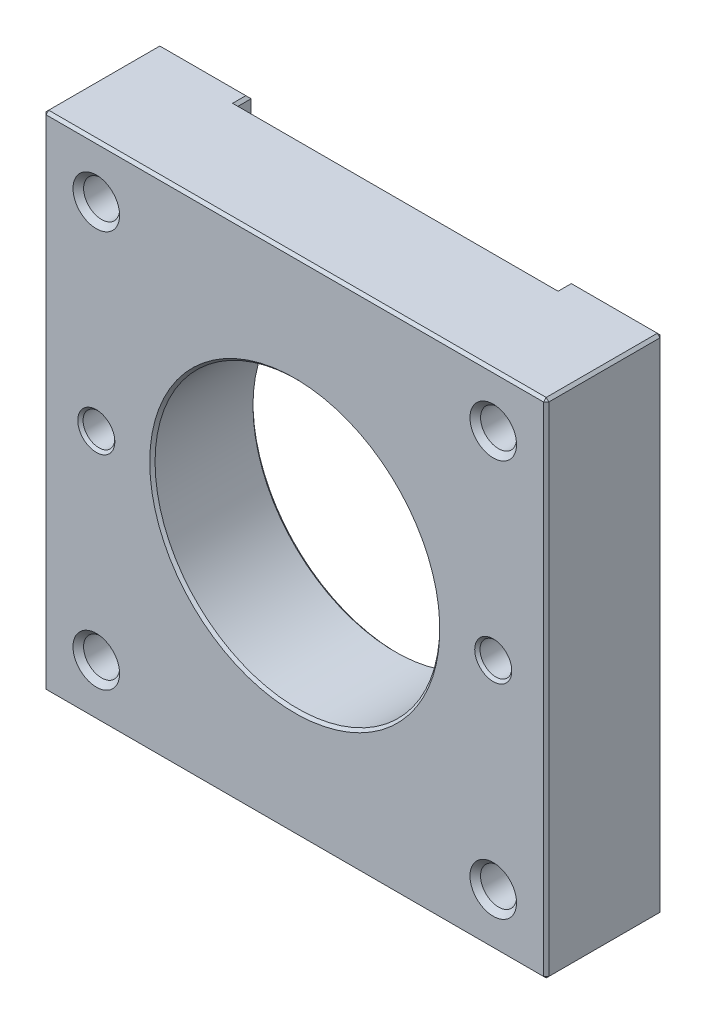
ISO-10303-21;
HEADER;
FILE_DESCRIPTION(('STEP AP214'),'2;1');
FILE_NAME('part.step','',(''),(''),'','','');
FILE_SCHEMA(('AUTOMOTIVE_DESIGN { 1 0 10303 214 1 1 1 1 }'));
ENDSEC;
DATA;
#1=APPLICATION_CONTEXT('core data for automotive mechanical design processes');
#2=APPLICATION_PROTOCOL_DEFINITION('international standard','automotive_design',2000,#1);
#3=PRODUCT_CONTEXT('',#1,'mechanical');
#4=PRODUCT('Part','Part','',(#3));
#5=PRODUCT_RELATED_PRODUCT_CATEGORY('part','',(#4));
#6=PRODUCT_DEFINITION_FORMATION('','',#4);
#7=PRODUCT_DEFINITION_CONTEXT('part definition',#1,'design');
#8=PRODUCT_DEFINITION('design','',#6,#7);
#9=PRODUCT_DEFINITION_SHAPE('','',#8);
#10=(LENGTH_UNIT() NAMED_UNIT(*) SI_UNIT(.MILLI.,.METRE.));
#11=(NAMED_UNIT(*) PLANE_ANGLE_UNIT() SI_UNIT($,.RADIAN.));
#12=(NAMED_UNIT(*) SI_UNIT($,.STERADIAN.) SOLID_ANGLE_UNIT());
#13=UNCERTAINTY_MEASURE_WITH_UNIT(LENGTH_MEASURE(1.E-05),#10,'distance_accuracy_value','');
#14=(GEOMETRIC_REPRESENTATION_CONTEXT(3) GLOBAL_UNCERTAINTY_ASSIGNED_CONTEXT((#13)) GLOBAL_UNIT_ASSIGNED_CONTEXT((#10,
#11,#12)) REPRESENTATION_CONTEXT('',''));
#15=CARTESIAN_POINT('',(0.,0.,0.));
#16=DIRECTION('',(0.,0.,1.));
#17=DIRECTION('',(1.,0.,0.));
#18=AXIS2_PLACEMENT_3D('',#15,#16,#17);
#19=CARTESIAN_POINT('',(-47.5,-47.5,0.));
#20=DIRECTION('',(0.,0.,-1.));
#21=DIRECTION('',(-1.,0.,0.));
#22=AXIS2_PLACEMENT_3D('',#19,#20,#21);
#23=PLANE('',#22);
#24=CARTESIAN_POINT('',(37.5,0.,0.));
#25=DIRECTION('',(0.,0.,-1.));
#26=DIRECTION('',(-1.,0.,0.));
#27=AXIS2_PLACEMENT_3D('',#24,#25,#26);
#28=CIRCLE('',#27,3.50000000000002);
#29=CARTESIAN_POINT('',(34.,0.,0.));
#30=VERTEX_POINT('',#29);
#31=EDGE_CURVE('E554',#30,#30,#28,.F.);
#32=ORIENTED_EDGE('',*,*,#31,.T.);
#33=EDGE_LOOP('',(#32));
#34=FACE_BOUND('',#33,.T.);
#35=CARTESIAN_POINT('',(37.5,37.5,0.));
#36=DIRECTION('',(0.,0.,-1.));
#37=DIRECTION('',(-1.,0.,0.));
#38=AXIS2_PLACEMENT_3D('',#35,#36,#37);
#39=CIRCLE('',#38,4.40000000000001);
#40=CARTESIAN_POINT('',(33.1,37.5,0.));
#41=VERTEX_POINT('',#40);
#42=EDGE_CURVE('E509',#41,#41,#39,.F.);
#43=ORIENTED_EDGE('',*,*,#42,.T.);
#44=EDGE_LOOP('',(#43));
#45=FACE_BOUND('',#44,.T.);
#46=CARTESIAN_POINT('',(37.5,-37.5,0.));
#47=DIRECTION('',(0.,0.,-1.));
#48=DIRECTION('',(-1.,0.,0.));
#49=AXIS2_PLACEMENT_3D('',#46,#47,#48);
#50=CIRCLE('',#49,4.40000000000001);
#51=CARTESIAN_POINT('',(33.1,-37.5,0.));
#52=VERTEX_POINT('',#51);
#53=EDGE_CURVE('E506',#52,#52,#50,.F.);
#54=ORIENTED_EDGE('',*,*,#53,.T.);
#55=EDGE_LOOP('',(#54));
#56=FACE_BOUND('',#55,.T.);
#57=DIRECTION('',(0.,-1.,0.));
#58=VECTOR('',#57,1.);
#59=CARTESIAN_POINT('',(30.25,47.5,0.));
#60=LINE('',#59,#58);
#61=CARTESIAN_POINT('',(30.25,47.,0.));
#62=VERTEX_POINT('',#61);
#63=CARTESIAN_POINT('',(30.25,-47.,0.));
#64=VERTEX_POINT('',#63);
#65=EDGE_CURVE('E182',#62,#64,#60,.T.);
#66=ORIENTED_EDGE('',*,*,#65,.F.);
#67=DIRECTION('',(1.,0.,0.));
#68=VECTOR('',#67,1.);
#69=CARTESIAN_POINT('',(-47.5,47.,0.));
#70=LINE('',#69,#68);
#71=CARTESIAN_POINT('',(47.,47.,0.));
#72=VERTEX_POINT('',#71);
#73=EDGE_CURVE('E196',#62,#72,#70,.T.);
#74=ORIENTED_EDGE('',*,*,#73,.T.);
#75=DIRECTION('',(0.,-1.,0.));
#76=VECTOR('',#75,1.);
#77=CARTESIAN_POINT('',(47.,-47.5,0.));
#78=LINE('',#77,#76);
#79=CARTESIAN_POINT('',(47.,-47.,0.));
#80=VERTEX_POINT('',#79);
#81=EDGE_CURVE('E215',#72,#80,#78,.T.);
#82=ORIENTED_EDGE('',*,*,#81,.T.);
#83=DIRECTION('',(-1.,0.,0.));
#84=VECTOR('',#83,1.);
#85=CARTESIAN_POINT('',(-47.5,-47.,0.));
#86=LINE('',#85,#84);
#87=EDGE_CURVE('E198',#80,#64,#86,.T.);
#88=ORIENTED_EDGE('',*,*,#87,.T.);
#89=EDGE_LOOP('',(#66,#74,#82,#88));
#90=FACE_BOUND('',#89,.T.);
#91=ADVANCED_FACE('F41',(#34,#45,#56,#90),#23,.T.);
#92=CARTESIAN_POINT('',(-47.5,-47.5,22.));
#93=DIRECTION('',(0.,0.,-1.));
#94=DIRECTION('',(-1.,0.,0.));
#95=AXIS2_PLACEMENT_3D('',#92,#93,#94);
#96=PLANE('',#95);
#97=DIRECTION('',(0.,1.,0.));
#98=VECTOR('',#97,1.);
#99=CARTESIAN_POINT('',(47.,-47.5,22.));
#100=LINE('',#99,#98);
#101=CARTESIAN_POINT('',(47.,-47.,22.));
#102=VERTEX_POINT('',#101);
#103=CARTESIAN_POINT('',(47.,47.,22.));
#104=VERTEX_POINT('',#103);
#105=EDGE_CURVE('E236',#102,#104,#100,.T.);
#106=ORIENTED_EDGE('',*,*,#105,.T.);
#107=DIRECTION('',(-1.,0.,0.));
#108=VECTOR('',#107,1.);
#109=CARTESIAN_POINT('',(-47.5,47.,22.));
#110=LINE('',#109,#108);
#111=CARTESIAN_POINT('',(-47.,47.,22.));
#112=VERTEX_POINT('',#111);
#113=EDGE_CURVE('E240',#104,#112,#110,.T.);
#114=ORIENTED_EDGE('',*,*,#113,.T.);
#115=DIRECTION('',(0.,-1.,0.));
#116=VECTOR('',#115,1.);
#117=CARTESIAN_POINT('',(-47.,-47.5,22.));
#118=LINE('',#117,#116);
#119=CARTESIAN_POINT('',(-47.,-47.,22.));
#120=VERTEX_POINT('',#119);
#121=EDGE_CURVE('E238',#112,#120,#118,.T.);
#122=ORIENTED_EDGE('',*,*,#121,.T.);
#123=DIRECTION('',(1.,0.,0.));
#124=VECTOR('',#123,1.);
#125=CARTESIAN_POINT('',(47.5,-47.,22.));
#126=LINE('',#125,#124);
#127=EDGE_CURVE('E234',#120,#102,#126,.T.);
#128=ORIENTED_EDGE('',*,*,#127,.T.);
#129=EDGE_LOOP('',(#106,#114,#122,#128));
#130=FACE_BOUND('',#129,.T.);
#131=CARTESIAN_POINT('',(0.,0.,22.));
#132=DIRECTION('',(0.,0.,-1.));
#133=DIRECTION('',(-1.,0.,0.));
#134=AXIS2_PLACEMENT_3D('',#131,#132,#133);
#135=CIRCLE('',#134,27.4);
#136=CARTESIAN_POINT('',(-27.4,0.,22.));
#137=VERTEX_POINT('',#136);
#138=EDGE_CURVE('E542',#137,#137,#135,.T.);
#139=ORIENTED_EDGE('',*,*,#138,.T.);
#140=EDGE_LOOP('',(#139));
#141=FACE_BOUND('',#140,.T.);
#142=CARTESIAN_POINT('',(-37.5,0.,22.));
#143=DIRECTION('',(0.,0.,-1.));
#144=DIRECTION('',(-1.,0.,0.));
#145=AXIS2_PLACEMENT_3D('',#142,#143,#144);
#146=CIRCLE('',#145,3.50000000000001);
#147=CARTESIAN_POINT('',(-41.,0.,22.));
#148=VERTEX_POINT('',#147);
#149=EDGE_CURVE('E539',#148,#148,#146,.T.);
#150=ORIENTED_EDGE('',*,*,#149,.T.);
#151=EDGE_LOOP('',(#150));
#152=FACE_BOUND('',#151,.T.);
#153=CARTESIAN_POINT('',(37.5,0.,22.));
#154=DIRECTION('',(0.,0.,-1.));
#155=DIRECTION('',(-1.,0.,0.));
#156=AXIS2_PLACEMENT_3D('',#153,#154,#155);
#157=CIRCLE('',#156,3.50000000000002);
#158=CARTESIAN_POINT('',(34.,0.,22.));
#159=VERTEX_POINT('',#158);
#160=EDGE_CURVE('E536',#159,#159,#157,.T.);
#161=ORIENTED_EDGE('',*,*,#160,.T.);
#162=EDGE_LOOP('',(#161));
#163=FACE_BOUND('',#162,.T.);
#164=CARTESIAN_POINT('',(-37.5,37.5,22.));
#165=DIRECTION('',(0.,0.,-1.));
#166=DIRECTION('',(-1.,0.,0.));
#167=AXIS2_PLACEMENT_3D('',#164,#165,#166);
#168=CIRCLE('',#167,4.40000000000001);
#169=CARTESIAN_POINT('',(-41.9,37.5,22.));
#170=VERTEX_POINT('',#169);
#171=EDGE_CURVE('E491',#170,#170,#168,.T.);
#172=ORIENTED_EDGE('',*,*,#171,.T.);
#173=EDGE_LOOP('',(#172));
#174=FACE_BOUND('',#173,.T.);
#175=CARTESIAN_POINT('',(-37.5,-37.5,22.));
#176=DIRECTION('',(0.,0.,-1.));
#177=DIRECTION('',(-1.,0.,0.));
#178=AXIS2_PLACEMENT_3D('',#175,#176,#177);
#179=CIRCLE('',#178,4.40000000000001);
#180=CARTESIAN_POINT('',(-41.9,-37.5,22.));
#181=VERTEX_POINT('',#180);
#182=EDGE_CURVE('E488',#181,#181,#179,.T.);
#183=ORIENTED_EDGE('',*,*,#182,.T.);
#184=EDGE_LOOP('',(#183));
#185=FACE_BOUND('',#184,.T.);
#186=CARTESIAN_POINT('',(37.5,37.5,22.));
#187=DIRECTION('',(0.,0.,-1.));
#188=DIRECTION('',(-1.,0.,0.));
#189=AXIS2_PLACEMENT_3D('',#186,#187,#188);
#190=CIRCLE('',#189,4.40000000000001);
#191=CARTESIAN_POINT('',(33.1,37.5,22.));
#192=VERTEX_POINT('',#191);
#193=EDGE_CURVE('E481',#192,#192,#190,.T.);
#194=ORIENTED_EDGE('',*,*,#193,.T.);
#195=EDGE_LOOP('',(#194));
#196=FACE_BOUND('',#195,.T.);
#197=CARTESIAN_POINT('',(37.5,-37.5,22.));
#198=DIRECTION('',(0.,0.,-1.));
#199=DIRECTION('',(-1.,0.,0.));
#200=AXIS2_PLACEMENT_3D('',#197,#198,#199);
#201=CIRCLE('',#200,4.40000000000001);
#202=CARTESIAN_POINT('',(33.1,-37.5,22.));
#203=VERTEX_POINT('',#202);
#204=EDGE_CURVE('E478',#203,#203,#201,.T.);
#205=ORIENTED_EDGE('',*,*,#204,.T.);
#206=EDGE_LOOP('',(#205));
#207=FACE_BOUND('',#206,.T.);
#208=ADVANCED_FACE('F431',(#130,#141,#152,#163,#174,#185,#196,#207),#96,.F.);
#209=CARTESIAN_POINT('',(-37.5,0.,0.));
#210=DIRECTION('',(0.,0.,-1.));
#211=DIRECTION('',(-1.,0.,0.));
#212=AXIS2_PLACEMENT_3D('',#209,#210,#211);
#213=CIRCLE('',#212,3.50000000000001);
#214=CARTESIAN_POINT('',(-41.,0.,0.));
#215=VERTEX_POINT('',#214);
#216=EDGE_CURVE('E557',#215,#215,#213,.F.);
#217=ORIENTED_EDGE('',*,*,#216,.T.);
#218=EDGE_LOOP('',(#217));
#219=FACE_BOUND('',#218,.T.);
#220=CARTESIAN_POINT('',(-37.5,37.5,0.));
#221=DIRECTION('',(0.,0.,-1.));
#222=DIRECTION('',(-1.,0.,0.));
#223=AXIS2_PLACEMENT_3D('',#220,#221,#222);
#224=CIRCLE('',#223,4.40000000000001);
#225=CARTESIAN_POINT('',(-41.9,37.5,0.));
#226=VERTEX_POINT('',#225);
#227=EDGE_CURVE('E521',#226,#226,#224,.F.);
#228=ORIENTED_EDGE('',*,*,#227,.T.);
#229=EDGE_LOOP('',(#228));
#230=FACE_BOUND('',#229,.T.);
#231=CARTESIAN_POINT('',(-37.5,-37.5,0.));
#232=DIRECTION('',(0.,0.,-1.));
#233=DIRECTION('',(-1.,0.,0.));
#234=AXIS2_PLACEMENT_3D('',#231,#232,#233);
#235=CIRCLE('',#234,4.40000000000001);
#236=CARTESIAN_POINT('',(-41.9,-37.5,0.));
#237=VERTEX_POINT('',#236);
#238=EDGE_CURVE('E518',#237,#237,#235,.F.);
#239=ORIENTED_EDGE('',*,*,#238,.T.);
#240=EDGE_LOOP('',(#239));
#241=FACE_BOUND('',#240,.T.);
#242=DIRECTION('',(0.,1.,0.));
#243=VECTOR('',#242,1.);
#244=CARTESIAN_POINT('',(-47.,47.5,0.));
#245=LINE('',#244,#243);
#246=CARTESIAN_POINT('',(-47.,-47.,0.));
#247=VERTEX_POINT('',#246);
#248=CARTESIAN_POINT('',(-47.,47.,0.));
#249=VERTEX_POINT('',#248);
#250=EDGE_CURVE('E245',#247,#249,#245,.T.);
#251=ORIENTED_EDGE('',*,*,#250,.T.);
#252=DIRECTION('',(1.,0.,0.));
#253=VECTOR('',#252,1.);
#254=CARTESIAN_POINT('',(-47.5,47.,0.));
#255=LINE('',#254,#253);
#256=CARTESIAN_POINT('',(-30.25,47.,0.));
#257=VERTEX_POINT('',#256);
#258=EDGE_CURVE('E247',#249,#257,#255,.T.);
#259=ORIENTED_EDGE('',*,*,#258,.T.);
#260=DIRECTION('',(0.,1.,0.));
#261=VECTOR('',#260,1.);
#262=CARTESIAN_POINT('',(-30.25,-47.5,0.));
#263=LINE('',#262,#261);
#264=CARTESIAN_POINT('',(-30.25,-47.,0.));
#265=VERTEX_POINT('',#264);
#266=EDGE_CURVE('E199',#265,#257,#263,.T.);
#267=ORIENTED_EDGE('',*,*,#266,.F.);
#268=DIRECTION('',(-1.,0.,0.));
#269=VECTOR('',#268,1.);
#270=CARTESIAN_POINT('',(-47.5,-47.,0.));
#271=LINE('',#270,#269);
#272=EDGE_CURVE('E243',#265,#247,#271,.T.);
#273=ORIENTED_EDGE('',*,*,#272,.T.);
#274=EDGE_LOOP('',(#251,#259,#267,#273));
#275=FACE_BOUND('',#274,.T.);
#276=ADVANCED_FACE('F384',(#219,#230,#241,#275),#23,.T.);
#277=CARTESIAN_POINT('',(-47.5,47.5,22.));
#278=DIRECTION('',(1.,0.,0.));
#279=DIRECTION('',(0.,1.,0.));
#280=AXIS2_PLACEMENT_3D('',#277,#278,#279);
#281=PLANE('',#280);
#282=DIRECTION('',(0.,1.,0.));
#283=VECTOR('',#282,1.);
#284=CARTESIAN_POINT('',(-47.5,47.5,21.5));
#285=LINE('',#284,#283);
#286=CARTESIAN_POINT('',(-47.5,-47.,21.5));
#287=VERTEX_POINT('',#286);
#288=CARTESIAN_POINT('',(-47.5,47.,21.5));
#289=VERTEX_POINT('',#288);
#290=EDGE_CURVE('E261',#287,#289,#285,.T.);
#291=ORIENTED_EDGE('',*,*,#290,.T.);
#292=DIRECTION('',(0.,0.,-1.));
#293=VECTOR('',#292,1.);
#294=CARTESIAN_POINT('',(-47.5,47.,0.));
#295=LINE('',#294,#293);
#296=CARTESIAN_POINT('',(-47.5,47.,0.500000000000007));
#297=VERTEX_POINT('',#296);
#298=EDGE_CURVE('E263',#289,#297,#295,.T.);
#299=ORIENTED_EDGE('',*,*,#298,.T.);
#300=DIRECTION('',(0.,-1.,0.));
#301=VECTOR('',#300,1.);
#302=CARTESIAN_POINT('',(-47.5,-47.5,0.500000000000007));
#303=LINE('',#302,#301);
#304=CARTESIAN_POINT('',(-47.5,-47.,0.500000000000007));
#305=VERTEX_POINT('',#304);
#306=EDGE_CURVE('E259',#297,#305,#303,.T.);
#307=ORIENTED_EDGE('',*,*,#306,.T.);
#308=DIRECTION('',(0.,0.,1.));
#309=VECTOR('',#308,1.);
#310=CARTESIAN_POINT('',(-47.5,-47.,22.));
#311=LINE('',#310,#309);
#312=EDGE_CURVE('E190',#305,#287,#311,.T.);
#313=ORIENTED_EDGE('',*,*,#312,.T.);
#314=EDGE_LOOP('',(#291,#299,#307,#313));
#315=FACE_BOUND('',#314,.T.);
#316=ADVANCED_FACE('F453',(#315),#281,.F.);
#317=CARTESIAN_POINT('',(47.5,-47.5,22.));
#318=DIRECTION('',(0.,-1.,0.));
#319=DIRECTION('',(1.,0.,0.));
#320=AXIS2_PLACEMENT_3D('',#317,#318,#319);
#321=PLANE('',#320);
#322=DIRECTION('',(0.,0.,1.));
#323=VECTOR('',#322,1.);
#324=CARTESIAN_POINT('',(-30.75,-47.5,2.5));
#325=LINE('',#324,#323);
#326=CARTESIAN_POINT('',(-30.75,-47.5,0.500000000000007));
#327=VERTEX_POINT('',#326);
#328=CARTESIAN_POINT('',(-30.75,-47.5,3.00000000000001));
#329=VERTEX_POINT('',#328);
#330=EDGE_CURVE('E50',#327,#329,#325,.T.);
#331=ORIENTED_EDGE('',*,*,#330,.T.);
#332=DIRECTION('',(1.,0.,0.));
#333=VECTOR('',#332,1.);
#334=CARTESIAN_POINT('',(30.25,-47.5,3.00000000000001));
#335=LINE('',#334,#333);
#336=CARTESIAN_POINT('',(30.75,-47.5,3.00000000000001));
#337=VERTEX_POINT('',#336);
#338=EDGE_CURVE('E11',#329,#337,#335,.T.);
#339=ORIENTED_EDGE('',*,*,#338,.T.);
#340=DIRECTION('',(0.,0.,-1.));
#341=VECTOR('',#340,1.);
#342=CARTESIAN_POINT('',(30.75,-47.5,0.));
#343=LINE('',#342,#341);
#344=CARTESIAN_POINT('',(30.75,-47.5,0.500000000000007));
#345=VERTEX_POINT('',#344);
#346=EDGE_CURVE('E275',#337,#345,#343,.T.);
#347=ORIENTED_EDGE('',*,*,#346,.T.);
#348=DIRECTION('',(1.,0.,0.));
#349=VECTOR('',#348,1.);
#350=CARTESIAN_POINT('',(47.5,-47.5,0.500000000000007));
#351=LINE('',#350,#349);
#352=CARTESIAN_POINT('',(47.,-47.5,0.500000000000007));
#353=VERTEX_POINT('',#352);
#354=EDGE_CURVE('E277',#345,#353,#351,.T.);
#355=ORIENTED_EDGE('',*,*,#354,.T.);
#356=DIRECTION('',(0.,0.,1.));
#357=VECTOR('',#356,1.);
#358=CARTESIAN_POINT('',(47.,-47.5,22.));
#359=LINE('',#358,#357);
#360=CARTESIAN_POINT('',(47.,-47.5,21.5));
#361=VERTEX_POINT('',#360);
#362=EDGE_CURVE('E279',#353,#361,#359,.T.);
#363=ORIENTED_EDGE('',*,*,#362,.T.);
#364=DIRECTION('',(-1.,0.,0.));
#365=VECTOR('',#364,1.);
#366=CARTESIAN_POINT('',(-47.5,-47.5,21.5));
#367=LINE('',#366,#365);
#368=CARTESIAN_POINT('',(-47.,-47.5,21.5));
#369=VERTEX_POINT('',#368);
#370=EDGE_CURVE('E281',#361,#369,#367,.T.);
#371=ORIENTED_EDGE('',*,*,#370,.T.);
#372=DIRECTION('',(0.,0.,-1.));
#373=VECTOR('',#372,1.);
#374=CARTESIAN_POINT('',(-47.,-47.5,0.));
#375=LINE('',#374,#373);
#376=CARTESIAN_POINT('',(-47.,-47.5,0.500000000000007));
#377=VERTEX_POINT('',#376);
#378=EDGE_CURVE('E283',#369,#377,#375,.T.);
#379=ORIENTED_EDGE('',*,*,#378,.T.);
#380=DIRECTION('',(1.,0.,0.));
#381=VECTOR('',#380,1.);
#382=CARTESIAN_POINT('',(47.5,-47.5,0.500000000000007));
#383=LINE('',#382,#381);
#384=EDGE_CURVE('E61',#377,#327,#383,.T.);
#385=ORIENTED_EDGE('',*,*,#384,.T.);
#386=EDGE_LOOP('',(#331,#339,#347,#355,#363,#371,#379,#385));
#387=FACE_BOUND('',#386,.T.);
#388=ADVANCED_FACE('F398',(#387),#321,.T.);
#389=CARTESIAN_POINT('',(47.5,-47.5,22.));
#390=DIRECTION('',(-1.,0.,0.));
#391=DIRECTION('',(0.,0.,1.));
#392=AXIS2_PLACEMENT_3D('',#389,#390,#391);
#393=PLANE('',#392);
#394=DIRECTION('',(0.,0.,1.));
#395=VECTOR('',#394,1.);
#396=CARTESIAN_POINT('',(47.5,47.,22.));
#397=LINE('',#396,#395);
#398=CARTESIAN_POINT('',(47.5,47.,0.500000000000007));
#399=VERTEX_POINT('',#398);
#400=CARTESIAN_POINT('',(47.5,47.,21.5));
#401=VERTEX_POINT('',#400);
#402=EDGE_CURVE('E270',#399,#401,#397,.T.);
#403=ORIENTED_EDGE('',*,*,#402,.T.);
#404=DIRECTION('',(0.,-1.,0.));
#405=VECTOR('',#404,1.);
#406=CARTESIAN_POINT('',(47.5,-47.5,21.5));
#407=LINE('',#406,#405);
#408=CARTESIAN_POINT('',(47.5,-47.,21.5));
#409=VERTEX_POINT('',#408);
#410=EDGE_CURVE('E272',#401,#409,#407,.T.);
#411=ORIENTED_EDGE('',*,*,#410,.T.);
#412=DIRECTION('',(0.,0.,-1.));
#413=VECTOR('',#412,1.);
#414=CARTESIAN_POINT('',(47.5,-47.,0.));
#415=LINE('',#414,#413);
#416=CARTESIAN_POINT('',(47.5,-47.,0.500000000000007));
#417=VERTEX_POINT('',#416);
#418=EDGE_CURVE('E266',#409,#417,#415,.T.);
#419=ORIENTED_EDGE('',*,*,#418,.T.);
#420=DIRECTION('',(0.,1.,0.));
#421=VECTOR('',#420,1.);
#422=CARTESIAN_POINT('',(47.5,47.5,0.500000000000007));
#423=LINE('',#422,#421);
#424=EDGE_CURVE('E268',#417,#399,#423,.T.);
#425=ORIENTED_EDGE('',*,*,#424,.T.);
#426=EDGE_LOOP('',(#403,#411,#419,#425));
#427=FACE_BOUND('',#426,.T.);
#428=ADVANCED_FACE('F615',(#427),#393,.F.);
#429=CARTESIAN_POINT('',(-47.5,47.5,22.));
#430=DIRECTION('',(0.,1.,0.));
#431=DIRECTION('',(0.,0.,1.));
#432=AXIS2_PLACEMENT_3D('',#429,#430,#431);
#433=PLANE('',#432);
#434=DIRECTION('',(0.,0.,-1.));
#435=VECTOR('',#434,1.);
#436=CARTESIAN_POINT('',(-30.75,47.5,0.));
#437=LINE('',#436,#435);
#438=CARTESIAN_POINT('',(-30.75,47.5,3.00000000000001));
#439=VERTEX_POINT('',#438);
#440=CARTESIAN_POINT('',(-30.75,47.5,0.500000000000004));
#441=VERTEX_POINT('',#440);
#442=EDGE_CURVE('E230',#439,#441,#437,.T.);
#443=ORIENTED_EDGE('',*,*,#442,.T.);
#444=DIRECTION('',(-1.,0.,0.));
#445=VECTOR('',#444,1.);
#446=CARTESIAN_POINT('',(-47.5,47.5,0.500000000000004));
#447=LINE('',#446,#445);
#448=CARTESIAN_POINT('',(-47.,47.5,0.500000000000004));
#449=VERTEX_POINT('',#448);
#450=EDGE_CURVE('E232',#441,#449,#447,.T.);
#451=ORIENTED_EDGE('',*,*,#450,.T.);
#452=DIRECTION('',(0.,0.,1.));
#453=VECTOR('',#452,1.);
#454=CARTESIAN_POINT('',(-47.,47.5,22.));
#455=LINE('',#454,#453);
#456=CARTESIAN_POINT('',(-47.,47.5,21.5));
#457=VERTEX_POINT('',#456);
#458=EDGE_CURVE('E225',#449,#457,#455,.T.);
#459=ORIENTED_EDGE('',*,*,#458,.T.);
#460=DIRECTION('',(1.,0.,0.));
#461=VECTOR('',#460,1.);
#462=CARTESIAN_POINT('',(47.5,47.5,21.5));
#463=LINE('',#462,#461);
#464=CARTESIAN_POINT('',(47.,47.5,21.5));
#465=VERTEX_POINT('',#464);
#466=EDGE_CURVE('E217',#457,#465,#463,.T.);
#467=ORIENTED_EDGE('',*,*,#466,.T.);
#468=DIRECTION('',(0.,0.,-1.));
#469=VECTOR('',#468,1.);
#470=CARTESIAN_POINT('',(47.,47.5,0.));
#471=LINE('',#470,#469);
#472=CARTESIAN_POINT('',(47.,47.5,0.500000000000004));
#473=VERTEX_POINT('',#472);
#474=EDGE_CURVE('E214',#465,#473,#471,.T.);
#475=ORIENTED_EDGE('',*,*,#474,.T.);
#476=DIRECTION('',(-1.,0.,0.));
#477=VECTOR('',#476,1.);
#478=CARTESIAN_POINT('',(-47.5,47.5,0.500000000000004));
#479=LINE('',#478,#477);
#480=CARTESIAN_POINT('',(30.75,47.5,0.500000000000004));
#481=VERTEX_POINT('',#480);
#482=EDGE_CURVE('E223',#473,#481,#479,.T.);
#483=ORIENTED_EDGE('',*,*,#482,.T.);
#484=DIRECTION('',(0.,0.,1.));
#485=VECTOR('',#484,1.);
#486=CARTESIAN_POINT('',(30.75,47.5,2.5));
#487=LINE('',#486,#485);
#488=CARTESIAN_POINT('',(30.75,47.5,3.00000000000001));
#489=VERTEX_POINT('',#488);
#490=EDGE_CURVE('E204',#481,#489,#487,.T.);
#491=ORIENTED_EDGE('',*,*,#490,.T.);
#492=DIRECTION('',(-1.,0.,0.));
#493=VECTOR('',#492,1.);
#494=CARTESIAN_POINT('',(-30.25,47.5,3.00000000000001));
#495=LINE('',#494,#493);
#496=EDGE_CURVE('E228',#489,#439,#495,.T.);
#497=ORIENTED_EDGE('',*,*,#496,.T.);
#498=EDGE_LOOP('',(#443,#451,#459,#467,#475,#483,#491,#497));
#499=FACE_BOUND('',#498,.T.);
#500=ADVANCED_FACE('F611',(#499),#433,.T.);
#501=CARTESIAN_POINT('',(-37.5,-37.5,22.));
#502=DIRECTION('',(0.,0.,-1.));
#503=DIRECTION('',(-1.,0.,0.));
#504=AXIS2_PLACEMENT_3D('',#501,#502,#503);
#505=CYLINDRICAL_SURFACE('',#504,3.4);
#506=CARTESIAN_POINT('',(-37.5,-37.5,1.00000000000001));
#507=DIRECTION('',(0.,0.,-1.));
#508=DIRECTION('',(-1.,0.,0.));
#509=AXIS2_PLACEMENT_3D('',#506,#507,#508);
#510=CIRCLE('',#509,3.4);
#511=CARTESIAN_POINT('',(-40.9,-37.5,1.00000000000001));
#512=VERTEX_POINT('',#511);
#513=EDGE_CURVE('E524',#512,#512,#510,.T.);
#514=ORIENTED_EDGE('',*,*,#513,.T.);
#515=EDGE_LOOP('',(#514));
#516=FACE_BOUND('',#515,.T.);
#517=CARTESIAN_POINT('',(-37.5,-37.5,21.));
#518=DIRECTION('',(0.,0.,-1.));
#519=DIRECTION('',(-1.,0.,0.));
#520=AXIS2_PLACEMENT_3D('',#517,#518,#519);
#521=CIRCLE('',#520,3.4);
#522=CARTESIAN_POINT('',(-40.9,-37.5,21.));
#523=VERTEX_POINT('',#522);
#524=EDGE_CURVE('E497',#523,#523,#521,.F.);
#525=ORIENTED_EDGE('',*,*,#524,.T.);
#526=EDGE_LOOP('',(#525));
#527=FACE_BOUND('',#526,.T.);
#528=ADVANCED_FACE('F614',(#516,#527),#505,.F.);
#529=CARTESIAN_POINT('',(0.,0.,22.));
#530=DIRECTION('',(0.,0.,-1.));
#531=DIRECTION('',(-1.,0.,0.));
#532=AXIS2_PLACEMENT_3D('',#529,#530,#531);
#533=CYLINDRICAL_SURFACE('',#532,26.9);
#534=CARTESIAN_POINT('',(0.,0.,21.5));
#535=DIRECTION('',(0.,0.,-1.));
#536=DIRECTION('',(-1.,0.,0.));
#537=AXIS2_PLACEMENT_3D('',#534,#535,#536);
#538=CIRCLE('',#537,26.9);
#539=CARTESIAN_POINT('',(-26.9,0.,21.5));
#540=VERTEX_POINT('',#539);
#541=EDGE_CURVE('E533',#540,#540,#538,.F.);
#542=ORIENTED_EDGE('',*,*,#541,.T.);
#543=EDGE_LOOP('',(#542));
#544=FACE_BOUND('',#543,.T.);
#545=CARTESIAN_POINT('',(0.,0.,3.));
#546=DIRECTION('',(0.,0.,1.));
#547=DIRECTION('',(1.,0.,0.));
#548=AXIS2_PLACEMENT_3D('',#545,#546,#547);
#549=CIRCLE('',#548,26.9);
#550=CARTESIAN_POINT('',(26.9,0.,3.));
#551=VERTEX_POINT('',#550);
#552=EDGE_CURVE('E530',#551,#551,#549,.F.);
#553=ORIENTED_EDGE('',*,*,#552,.T.);
#554=EDGE_LOOP('',(#553));
#555=FACE_BOUND('',#554,.T.);
#556=ADVANCED_FACE('F674',(#544,#555),#533,.F.);
#557=CARTESIAN_POINT('',(-37.5,37.5,22.));
#558=DIRECTION('',(0.,0.,-1.));
#559=DIRECTION('',(-1.,0.,0.));
#560=AXIS2_PLACEMENT_3D('',#557,#558,#559);
#561=CYLINDRICAL_SURFACE('',#560,3.4);
#562=CARTESIAN_POINT('',(-37.5,37.5,1.00000000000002));
#563=DIRECTION('',(0.,0.,-1.));
#564=DIRECTION('',(-1.,0.,0.));
#565=AXIS2_PLACEMENT_3D('',#562,#563,#564);
#566=CIRCLE('',#565,3.4);
#567=CARTESIAN_POINT('',(-40.9,37.5,1.00000000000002));
#568=VERTEX_POINT('',#567);
#569=EDGE_CURVE('E515',#568,#568,#566,.T.);
#570=ORIENTED_EDGE('',*,*,#569,.T.);
#571=EDGE_LOOP('',(#570));
#572=FACE_BOUND('',#571,.T.);
#573=CARTESIAN_POINT('',(-37.5,37.5,21.));
#574=DIRECTION('',(0.,0.,-1.));
#575=DIRECTION('',(-1.,0.,0.));
#576=AXIS2_PLACEMENT_3D('',#573,#574,#575);
#577=CIRCLE('',#576,3.4);
#578=CARTESIAN_POINT('',(-40.9,37.5,21.));
#579=VERTEX_POINT('',#578);
#580=EDGE_CURVE('E494',#579,#579,#577,.F.);
#581=ORIENTED_EDGE('',*,*,#580,.T.);
#582=EDGE_LOOP('',(#581));
#583=FACE_BOUND('',#582,.T.);
#584=ADVANCED_FACE('F667',(#572,#583),#561,.F.);
#585=CARTESIAN_POINT('',(37.5,37.5,22.));
#586=DIRECTION('',(0.,0.,-1.));
#587=DIRECTION('',(-1.,0.,0.));
#588=AXIS2_PLACEMENT_3D('',#585,#586,#587);
#589=CYLINDRICAL_SURFACE('',#588,3.4);
#590=CARTESIAN_POINT('',(37.5,37.5,1.00000000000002));
#591=DIRECTION('',(0.,0.,-1.));
#592=DIRECTION('',(-1.,0.,0.));
#593=AXIS2_PLACEMENT_3D('',#590,#591,#592);
#594=CIRCLE('',#593,3.4);
#595=CARTESIAN_POINT('',(34.1,37.5,1.00000000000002));
#596=VERTEX_POINT('',#595);
#597=EDGE_CURVE('E512',#596,#596,#594,.T.);
#598=ORIENTED_EDGE('',*,*,#597,.T.);
#599=EDGE_LOOP('',(#598));
#600=FACE_BOUND('',#599,.T.);
#601=CARTESIAN_POINT('',(37.5,37.5,21.));
#602=DIRECTION('',(0.,0.,-1.));
#603=DIRECTION('',(-1.,0.,0.));
#604=AXIS2_PLACEMENT_3D('',#601,#602,#603);
#605=CIRCLE('',#604,3.4);
#606=CARTESIAN_POINT('',(34.1,37.5,21.));
#607=VERTEX_POINT('',#606);
#608=EDGE_CURVE('E500',#607,#607,#605,.F.);
#609=ORIENTED_EDGE('',*,*,#608,.T.);
#610=EDGE_LOOP('',(#609));
#611=FACE_BOUND('',#610,.T.);
#612=ADVANCED_FACE('F655',(#600,#611),#589,.F.);
#613=CARTESIAN_POINT('',(37.5,-37.5,22.));
#614=DIRECTION('',(0.,0.,-1.));
#615=DIRECTION('',(-1.,0.,0.));
#616=AXIS2_PLACEMENT_3D('',#613,#614,#615);
#617=CYLINDRICAL_SURFACE('',#616,3.4);
#618=CARTESIAN_POINT('',(37.5,-37.5,1.00000000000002));
#619=DIRECTION('',(0.,0.,-1.));
#620=DIRECTION('',(-1.,0.,0.));
#621=AXIS2_PLACEMENT_3D('',#618,#619,#620);
#622=CIRCLE('',#621,3.4);
#623=CARTESIAN_POINT('',(34.1,-37.5,1.00000000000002));
#624=VERTEX_POINT('',#623);
#625=EDGE_CURVE('E527',#624,#624,#622,.T.);
#626=ORIENTED_EDGE('',*,*,#625,.T.);
#627=EDGE_LOOP('',(#626));
#628=FACE_BOUND('',#627,.T.);
#629=CARTESIAN_POINT('',(37.5,-37.5,21.));
#630=DIRECTION('',(0.,0.,-1.));
#631=DIRECTION('',(-1.,0.,0.));
#632=AXIS2_PLACEMENT_3D('',#629,#630,#631);
#633=CIRCLE('',#632,3.4);
#634=CARTESIAN_POINT('',(34.1,-37.5,21.));
#635=VERTEX_POINT('',#634);
#636=EDGE_CURVE('E503',#635,#635,#633,.F.);
#637=ORIENTED_EDGE('',*,*,#636,.T.);
#638=EDGE_LOOP('',(#637));
#639=FACE_BOUND('',#638,.T.);
#640=ADVANCED_FACE('F652',(#628,#639),#617,.F.);
#641=CARTESIAN_POINT('',(-37.5,0.,22.));
#642=DIRECTION('',(0.,0.,-1.));
#643=DIRECTION('',(-1.,0.,0.));
#644=AXIS2_PLACEMENT_3D('',#641,#642,#643);
#645=CYLINDRICAL_SURFACE('',#644,3.);
#646=CARTESIAN_POINT('',(-37.5,0.,0.500000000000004));
#647=DIRECTION('',(0.,0.,-1.));
#648=DIRECTION('',(-1.,0.,0.));
#649=AXIS2_PLACEMENT_3D('',#646,#647,#648);
#650=CIRCLE('',#649,3.);
#651=CARTESIAN_POINT('',(-40.5,0.,0.500000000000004));
#652=VERTEX_POINT('',#651);
#653=EDGE_CURVE('E563',#652,#652,#650,.T.);
#654=ORIENTED_EDGE('',*,*,#653,.T.);
#655=EDGE_LOOP('',(#654));
#656=FACE_BOUND('',#655,.T.);
#657=CARTESIAN_POINT('',(-37.5,0.,21.5));
#658=DIRECTION('',(0.,0.,-1.));
#659=DIRECTION('',(-1.,0.,0.));
#660=AXIS2_PLACEMENT_3D('',#657,#658,#659);
#661=CIRCLE('',#660,3.);
#662=CARTESIAN_POINT('',(-40.5,0.,21.5));
#663=VERTEX_POINT('',#662);
#664=EDGE_CURVE('E560',#663,#663,#661,.F.);
#665=ORIENTED_EDGE('',*,*,#664,.T.);
#666=EDGE_LOOP('',(#665));
#667=FACE_BOUND('',#666,.T.);
#668=ADVANCED_FACE('F567',(#656,#667),#645,.F.);
#669=CARTESIAN_POINT('',(37.5,0.,22.));
#670=DIRECTION('',(0.,0.,-1.));
#671=DIRECTION('',(-1.,0.,0.));
#672=AXIS2_PLACEMENT_3D('',#669,#670,#671);
#673=CYLINDRICAL_SURFACE('',#672,3.00000000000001);
#674=CARTESIAN_POINT('',(37.5,0.,0.500000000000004));
#675=DIRECTION('',(0.,0.,-1.));
#676=DIRECTION('',(-1.,0.,0.));
#677=AXIS2_PLACEMENT_3D('',#674,#675,#676);
#678=CIRCLE('',#677,3.00000000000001);
#679=CARTESIAN_POINT('',(34.5,0.,0.500000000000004));
#680=VERTEX_POINT('',#679);
#681=EDGE_CURVE('E551',#680,#680,#678,.T.);
#682=ORIENTED_EDGE('',*,*,#681,.T.);
#683=EDGE_LOOP('',(#682));
#684=FACE_BOUND('',#683,.T.);
#685=CARTESIAN_POINT('',(37.5,0.,21.5));
#686=DIRECTION('',(0.,0.,-1.));
#687=DIRECTION('',(-1.,0.,0.));
#688=AXIS2_PLACEMENT_3D('',#685,#686,#687);
#689=CIRCLE('',#688,3.00000000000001);
#690=CARTESIAN_POINT('',(34.5,0.,21.5));
#691=VERTEX_POINT('',#690);
#692=EDGE_CURVE('E548',#691,#691,#689,.F.);
#693=ORIENTED_EDGE('',*,*,#692,.T.);
#694=EDGE_LOOP('',(#693));
#695=FACE_BOUND('',#694,.T.);
#696=ADVANCED_FACE('F665',(#684,#695),#673,.F.);
#697=CARTESIAN_POINT('',(30.25,47.5,2.5));
#698=DIRECTION('',(1.,0.,0.));
#699=DIRECTION('',(0.,1.,0.));
#700=AXIS2_PLACEMENT_3D('',#697,#698,#699);
#701=PLANE('',#700);
#702=DIRECTION('',(0.,-1.,0.));
#703=VECTOR('',#702,1.);
#704=CARTESIAN_POINT('',(30.25,47.5,2.5));
#705=LINE('',#704,#703);
#706=CARTESIAN_POINT('',(30.25,47.,2.5));
#707=VERTEX_POINT('',#706);
#708=CARTESIAN_POINT('',(30.25,-47.,2.5));
#709=VERTEX_POINT('',#708);
#710=EDGE_CURVE('E185',#707,#709,#705,.T.);
#711=ORIENTED_EDGE('',*,*,#710,.F.);
#712=DIRECTION('',(0.,0.,-1.));
#713=VECTOR('',#712,1.);
#714=CARTESIAN_POINT('',(30.25,47.,0.));
#715=LINE('',#714,#713);
#716=EDGE_CURVE('E179',#707,#62,#715,.T.);
#717=ORIENTED_EDGE('',*,*,#716,.T.);
#718=ORIENTED_EDGE('',*,*,#65,.T.);
#719=DIRECTION('',(0.,0.,1.));
#720=VECTOR('',#719,1.);
#721=CARTESIAN_POINT('',(30.25,-47.,2.5));
#722=LINE('',#721,#720);
#723=EDGE_CURVE('E191',#64,#709,#722,.T.);
#724=ORIENTED_EDGE('',*,*,#723,.T.);
#725=EDGE_LOOP('',(#711,#717,#718,#724));
#726=FACE_BOUND('',#725,.T.);
#727=ADVANCED_FACE('F181',(#726),#701,.F.);
#728=CARTESIAN_POINT('',(-30.25,-47.5,2.5));
#729=DIRECTION('',(-1.,0.,0.));
#730=DIRECTION('',(0.,-1.,0.));
#731=AXIS2_PLACEMENT_3D('',#728,#729,#730);
#732=PLANE('',#731);
#733=ORIENTED_EDGE('',*,*,#266,.T.);
#734=DIRECTION('',(0.,0.,1.));
#735=VECTOR('',#734,1.);
#736=CARTESIAN_POINT('',(-30.25,47.,2.5));
#737=LINE('',#736,#735);
#738=CARTESIAN_POINT('',(-30.25,47.,2.5));
#739=VERTEX_POINT('',#738);
#740=EDGE_CURVE('E251',#257,#739,#737,.T.);
#741=ORIENTED_EDGE('',*,*,#740,.T.);
#742=DIRECTION('',(0.,1.,0.));
#743=VECTOR('',#742,1.);
#744=CARTESIAN_POINT('',(-30.25,-47.5,2.5));
#745=LINE('',#744,#743);
#746=CARTESIAN_POINT('',(-30.25,-47.,2.5));
#747=VERTEX_POINT('',#746);
#748=EDGE_CURVE('E475',#747,#739,#745,.T.);
#749=ORIENTED_EDGE('',*,*,#748,.F.);
#750=DIRECTION('',(0.,0.,-1.));
#751=VECTOR('',#750,1.);
#752=CARTESIAN_POINT('',(-30.25,-47.,0.));
#753=LINE('',#752,#751);
#754=EDGE_CURVE('E249',#747,#265,#753,.T.);
#755=ORIENTED_EDGE('',*,*,#754,.T.);
#756=EDGE_LOOP('',(#733,#741,#749,#755));
#757=FACE_BOUND('',#756,.T.);
#758=ADVANCED_FACE('F474',(#757),#732,.F.);
#759=CARTESIAN_POINT('',(30.25,-47.5,2.5));
#760=DIRECTION('',(0.,0.,1.));
#761=DIRECTION('',(1.,0.,0.));
#762=AXIS2_PLACEMENT_3D('',#759,#760,#761);
#763=PLANE('',#762);
#764=CARTESIAN_POINT('',(0.,0.,2.5));
#765=DIRECTION('',(0.,0.,1.));
#766=DIRECTION('',(1.,0.,0.));
#767=AXIS2_PLACEMENT_3D('',#764,#765,#766);
#768=CIRCLE('',#767,27.4);
#769=CARTESIAN_POINT('',(27.4,0.,2.5));
#770=VERTEX_POINT('',#769);
#771=EDGE_CURVE('E545',#770,#770,#768,.T.);
#772=ORIENTED_EDGE('',*,*,#771,.T.);
#773=EDGE_LOOP('',(#772));
#774=FACE_BOUND('',#773,.T.);
#775=ORIENTED_EDGE('',*,*,#748,.T.);
#776=DIRECTION('',(1.,0.,0.));
#777=VECTOR('',#776,1.);
#778=CARTESIAN_POINT('',(30.25,47.,2.5));
#779=LINE('',#778,#777);
#780=EDGE_CURVE('E255',#739,#707,#779,.T.);
#781=ORIENTED_EDGE('',*,*,#780,.T.);
#782=ORIENTED_EDGE('',*,*,#710,.T.);
#783=DIRECTION('',(-1.,0.,0.));
#784=VECTOR('',#783,1.);
#785=CARTESIAN_POINT('',(-30.25,-47.,2.5));
#786=LINE('',#785,#784);
#787=EDGE_CURVE('E253',#709,#747,#786,.T.);
#788=ORIENTED_EDGE('',*,*,#787,.T.);
#789=EDGE_LOOP('',(#775,#781,#782,#788));
#790=FACE_BOUND('',#789,.T.);
#791=ADVANCED_FACE('F477',(#774,#790),#763,.F.);
#792=CARTESIAN_POINT('',(-37.5,37.5,22.));
#793=DIRECTION('',(0.,0.,1.));
#794=DIRECTION('',(1.,0.,0.));
#795=AXIS2_PLACEMENT_3D('',#792,#793,#794);
#796=CONICAL_SURFACE('',#795,4.40000000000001,0.785398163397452);
#797=ORIENTED_EDGE('',*,*,#580,.F.);
#798=EDGE_LOOP('',(#797));
#799=FACE_BOUND('',#798,.T.);
#800=ORIENTED_EDGE('',*,*,#171,.F.);
#801=EDGE_LOOP('',(#800));
#802=FACE_BOUND('',#801,.T.);
#803=ADVANCED_FACE('F624',(#799,#802),#796,.F.);
#804=CARTESIAN_POINT('',(-37.5,-37.5,21.));
#805=DIRECTION('',(0.,0.,1.));
#806=DIRECTION('',(1.,0.,0.));
#807=AXIS2_PLACEMENT_3D('',#804,#805,#806);
#808=CONICAL_SURFACE('',#807,3.4,0.785398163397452);
#809=ORIENTED_EDGE('',*,*,#182,.F.);
#810=EDGE_LOOP('',(#809));
#811=FACE_BOUND('',#810,.T.);
#812=ORIENTED_EDGE('',*,*,#524,.F.);
#813=EDGE_LOOP('',(#812));
#814=FACE_BOUND('',#813,.T.);
#815=ADVANCED_FACE('F627',(#811,#814),#808,.F.);
#816=CARTESIAN_POINT('',(37.5,37.5,21.));
#817=DIRECTION('',(0.,0.,1.));
#818=DIRECTION('',(1.,0.,0.));
#819=AXIS2_PLACEMENT_3D('',#816,#817,#818);
#820=CONICAL_SURFACE('',#819,3.4,0.785398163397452);
#821=ORIENTED_EDGE('',*,*,#193,.F.);
#822=EDGE_LOOP('',(#821));
#823=FACE_BOUND('',#822,.T.);
#824=ORIENTED_EDGE('',*,*,#608,.F.);
#825=EDGE_LOOP('',(#824));
#826=FACE_BOUND('',#825,.T.);
#827=ADVANCED_FACE('F631',(#823,#826),#820,.F.);
#828=CARTESIAN_POINT('',(37.5,-37.5,22.));
#829=DIRECTION('',(0.,0.,1.));
#830=DIRECTION('',(1.,0.,0.));
#831=AXIS2_PLACEMENT_3D('',#828,#829,#830);
#832=CONICAL_SURFACE('',#831,4.40000000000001,0.785398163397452);
#833=ORIENTED_EDGE('',*,*,#636,.F.);
#834=EDGE_LOOP('',(#833));
#835=FACE_BOUND('',#834,.T.);
#836=ORIENTED_EDGE('',*,*,#204,.F.);
#837=EDGE_LOOP('',(#836));
#838=FACE_BOUND('',#837,.T.);
#839=ADVANCED_FACE('F635',(#835,#838),#832,.F.);
#840=CARTESIAN_POINT('',(37.5,37.5,0.));
#841=DIRECTION('',(0.,0.,-1.));
#842=DIRECTION('',(-1.,0.,0.));
#843=AXIS2_PLACEMENT_3D('',#840,#841,#842);
#844=CONICAL_SURFACE('',#843,4.40000000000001,0.785398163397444);
#845=ORIENTED_EDGE('',*,*,#597,.F.);
#846=EDGE_LOOP('',(#845));
#847=FACE_BOUND('',#846,.T.);
#848=ORIENTED_EDGE('',*,*,#42,.F.);
#849=EDGE_LOOP('',(#848));
#850=FACE_BOUND('',#849,.T.);
#851=ADVANCED_FACE('F598',(#847,#850),#844,.F.);
#852=CARTESIAN_POINT('',(-37.5,37.5,1.00000000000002));
#853=DIRECTION('',(0.,0.,-1.));
#854=DIRECTION('',(-1.,0.,0.));
#855=AXIS2_PLACEMENT_3D('',#852,#853,#854);
#856=CONICAL_SURFACE('',#855,3.4,0.785398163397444);
#857=ORIENTED_EDGE('',*,*,#227,.F.);
#858=EDGE_LOOP('',(#857));
#859=FACE_BOUND('',#858,.T.);
#860=ORIENTED_EDGE('',*,*,#569,.F.);
#861=EDGE_LOOP('',(#860));
#862=FACE_BOUND('',#861,.T.);
#863=ADVANCED_FACE('F588',(#859,#862),#856,.F.);
#864=CARTESIAN_POINT('',(-37.5,-37.5,0.));
#865=DIRECTION('',(0.,0.,-1.));
#866=DIRECTION('',(-1.,0.,0.));
#867=AXIS2_PLACEMENT_3D('',#864,#865,#866);
#868=CONICAL_SURFACE('',#867,4.40000000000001,0.785398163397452);
#869=ORIENTED_EDGE('',*,*,#513,.F.);
#870=EDGE_LOOP('',(#869));
#871=FACE_BOUND('',#870,.T.);
#872=ORIENTED_EDGE('',*,*,#238,.F.);
#873=EDGE_LOOP('',(#872));
#874=FACE_BOUND('',#873,.T.);
#875=ADVANCED_FACE('F585',(#871,#874),#868,.F.);
#876=CARTESIAN_POINT('',(37.5,-37.5,1.00000000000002));
#877=DIRECTION('',(0.,0.,-1.));
#878=DIRECTION('',(-1.,0.,0.));
#879=AXIS2_PLACEMENT_3D('',#876,#877,#878);
#880=CONICAL_SURFACE('',#879,3.4,0.785398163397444);
#881=ORIENTED_EDGE('',*,*,#53,.F.);
#882=EDGE_LOOP('',(#881));
#883=FACE_BOUND('',#882,.T.);
#884=ORIENTED_EDGE('',*,*,#625,.F.);
#885=EDGE_LOOP('',(#884));
#886=FACE_BOUND('',#885,.T.);
#887=ADVANCED_FACE('F587',(#883,#886),#880,.F.);
#888=CARTESIAN_POINT('',(0.,0.,21.5));
#889=DIRECTION('',(0.,0.,1.));
#890=DIRECTION('',(1.,0.,0.));
#891=AXIS2_PLACEMENT_3D('',#888,#889,#890);
#892=CONICAL_SURFACE('',#891,26.9,0.785398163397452);
#893=ORIENTED_EDGE('',*,*,#138,.F.);
#894=EDGE_LOOP('',(#893));
#895=FACE_BOUND('',#894,.T.);
#896=ORIENTED_EDGE('',*,*,#541,.F.);
#897=EDGE_LOOP('',(#896));
#898=FACE_BOUND('',#897,.T.);
#899=ADVANCED_FACE('F595',(#895,#898),#892,.F.);
#900=CARTESIAN_POINT('',(0.,0.,2.5));
#901=DIRECTION('',(0.,0.,-1.));
#902=DIRECTION('',(-1.,0.,0.));
#903=AXIS2_PLACEMENT_3D('',#900,#901,#902);
#904=CONICAL_SURFACE('',#903,27.4,0.785398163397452);
#905=ORIENTED_EDGE('',*,*,#552,.F.);
#906=EDGE_LOOP('',(#905));
#907=FACE_BOUND('',#906,.T.);
#908=ORIENTED_EDGE('',*,*,#771,.F.);
#909=EDGE_LOOP('',(#908));
#910=FACE_BOUND('',#909,.T.);
#911=ADVANCED_FACE('F1112',(#907,#910),#904,.F.);
#912=CARTESIAN_POINT('',(37.5,0.,0.500000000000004));
#913=DIRECTION('',(0.,0.,-1.));
#914=DIRECTION('',(-1.,0.,0.));
#915=AXIS2_PLACEMENT_3D('',#912,#913,#914);
#916=CONICAL_SURFACE('',#915,3.00000000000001,0.785398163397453);
#917=ORIENTED_EDGE('',*,*,#31,.F.);
#918=EDGE_LOOP('',(#917));
#919=FACE_BOUND('',#918,.T.);
#920=ORIENTED_EDGE('',*,*,#681,.F.);
#921=EDGE_LOOP('',(#920));
#922=FACE_BOUND('',#921,.T.);
#923=ADVANCED_FACE('F574',(#919,#922),#916,.F.);
#924=CARTESIAN_POINT('',(-37.5,0.,0.));
#925=DIRECTION('',(0.,0.,-1.));
#926=DIRECTION('',(-1.,0.,0.));
#927=AXIS2_PLACEMENT_3D('',#924,#925,#926);
#928=CONICAL_SURFACE('',#927,3.50000000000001,0.785398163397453);
#929=ORIENTED_EDGE('',*,*,#653,.F.);
#930=EDGE_LOOP('',(#929));
#931=FACE_BOUND('',#930,.T.);
#932=ORIENTED_EDGE('',*,*,#216,.F.);
#933=EDGE_LOOP('',(#932));
#934=FACE_BOUND('',#933,.T.);
#935=ADVANCED_FACE('F570',(#931,#934),#928,.F.);
#936=CARTESIAN_POINT('',(-37.5,0.,21.5));
#937=DIRECTION('',(0.,0.,1.));
#938=DIRECTION('',(1.,0.,0.));
#939=AXIS2_PLACEMENT_3D('',#936,#937,#938);
#940=CONICAL_SURFACE('',#939,3.,0.785398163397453);
#941=ORIENTED_EDGE('',*,*,#149,.F.);
#942=EDGE_LOOP('',(#941));
#943=FACE_BOUND('',#942,.T.);
#944=ORIENTED_EDGE('',*,*,#664,.F.);
#945=EDGE_LOOP('',(#944));
#946=FACE_BOUND('',#945,.T.);
#947=ADVANCED_FACE('F573',(#943,#946),#940,.F.);
#948=CARTESIAN_POINT('',(37.5,0.,22.));
#949=DIRECTION('',(0.,0.,1.));
#950=DIRECTION('',(1.,0.,0.));
#951=AXIS2_PLACEMENT_3D('',#948,#949,#950);
#952=CONICAL_SURFACE('',#951,3.50000000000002,0.785398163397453);
#953=ORIENTED_EDGE('',*,*,#692,.F.);
#954=EDGE_LOOP('',(#953));
#955=FACE_BOUND('',#954,.T.);
#956=ORIENTED_EDGE('',*,*,#160,.F.);
#957=EDGE_LOOP('',(#956));
#958=FACE_BOUND('',#957,.T.);
#959=ADVANCED_FACE('F734',(#955,#958),#952,.F.);
#960=CARTESIAN_POINT('',(-47.5,-47.,0.));
#961=DIRECTION('',(0.,0.707106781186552,0.707106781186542));
#962=DIRECTION('',(0.,-0.707106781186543,0.707106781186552));
#963=AXIS2_PLACEMENT_3D('',#960,#961,#962);
#964=PLANE('',#963);
#965=DIRECTION('',(0.577350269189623,0.577350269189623,-0.577350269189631));
#966=VECTOR('',#965,1.);
#967=CARTESIAN_POINT('',(-36.,-52.7499999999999,5.75000000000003));
#968=LINE('',#967,#966);
#969=EDGE_CURVE('E364',#327,#265,#968,.T.);
#970=ORIENTED_EDGE('',*,*,#969,.F.);
#971=ORIENTED_EDGE('',*,*,#384,.F.);
#972=DIRECTION('',(0.,0.707106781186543,-0.707106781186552));
#973=VECTOR('',#972,1.);
#974=CARTESIAN_POINT('',(-47.,-47.25,0.25));
#975=LINE('',#974,#973);
#976=EDGE_CURVE('E366',#247,#377,#975,.F.);
#977=ORIENTED_EDGE('',*,*,#976,.F.);
#978=ORIENTED_EDGE('',*,*,#272,.F.);
#979=EDGE_LOOP('',(#970,#971,#977,#978));
#980=FACE_BOUND('',#979,.T.);
#981=ADVANCED_FACE('F43',(#980),#964,.F.);
#982=CARTESIAN_POINT('',(-47.,-47.5,22.));
#983=DIRECTION('',(-0.707106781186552,-0.707106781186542,0.));
#984=DIRECTION('',(0.707106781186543,-0.707106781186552,0.));
#985=AXIS2_PLACEMENT_3D('',#982,#983,#984);
#986=PLANE('',#985);
#987=DIRECTION('',(-0.707106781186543,0.707106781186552,0.));
#988=VECTOR('',#987,1.);
#989=CARTESIAN_POINT('',(-47.5,-47.,0.500000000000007));
#990=LINE('',#989,#988);
#991=EDGE_CURVE('E45',#377,#305,#990,.T.);
#992=ORIENTED_EDGE('',*,*,#991,.F.);
#993=ORIENTED_EDGE('',*,*,#378,.F.);
#994=DIRECTION('',(0.707106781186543,-0.707106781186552,0.));
#995=VECTOR('',#994,1.);
#996=CARTESIAN_POINT('',(-47.25,-47.25,21.5));
#997=LINE('',#996,#995);
#998=EDGE_CURVE('E361',#287,#369,#997,.T.);
#999=ORIENTED_EDGE('',*,*,#998,.F.);
#1000=ORIENTED_EDGE('',*,*,#312,.F.);
#1001=EDGE_LOOP('',(#992,#993,#999,#1000));
#1002=FACE_BOUND('',#1001,.T.);
#1003=ADVANCED_FACE('F451',(#1002),#986,.T.);
#1004=CARTESIAN_POINT('',(-47.5,-47.,0.500000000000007));
#1005=DIRECTION('',(-0.577350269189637,-0.577350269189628,-0.577350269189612));
#1006=DIRECTION('',(0.707106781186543,-0.707106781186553,0.));
#1007=AXIS2_PLACEMENT_3D('',#1004,#1005,#1006);
#1008=PLANE('',#1007);
#1009=ORIENTED_EDGE('',*,*,#976,.T.);
#1010=ORIENTED_EDGE('',*,*,#991,.T.);
#1011=DIRECTION('',(0.707106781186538,0.,-0.707106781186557));
#1012=VECTOR('',#1011,1.);
#1013=CARTESIAN_POINT('',(-47.5,-47.,0.500000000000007));
#1014=LINE('',#1013,#1012);
#1015=EDGE_CURVE('E358',#247,#305,#1014,.F.);
#1016=ORIENTED_EDGE('',*,*,#1015,.F.);
#1017=EDGE_LOOP('',(#1009,#1010,#1016));
#1018=FACE_BOUND('',#1017,.T.);
#1019=ADVANCED_FACE('F373',(#1018),#1008,.T.);
#1020=CARTESIAN_POINT('',(-30.25,-47.,2.5));
#1021=DIRECTION('',(0.707106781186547,-0.707106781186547,0.));
#1022=DIRECTION('',(0.707106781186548,0.707106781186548,0.));
#1023=AXIS2_PLACEMENT_3D('',#1020,#1021,#1022);
#1024=PLANE('',#1023);
#1025=ORIENTED_EDGE('',*,*,#969,.T.);
#1026=ORIENTED_EDGE('',*,*,#754,.F.);
#1027=DIRECTION('',(-0.577350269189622,-0.577350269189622,0.577350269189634));
#1028=VECTOR('',#1027,1.);
#1029=CARTESIAN_POINT('',(-4.66666666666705,-21.416666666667,-23.0833333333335));
#1030=LINE('',#1029,#1028);
#1031=EDGE_CURVE('E355',#329,#747,#1030,.F.);
#1032=ORIENTED_EDGE('',*,*,#1031,.F.);
#1033=ORIENTED_EDGE('',*,*,#330,.F.);
#1034=EDGE_LOOP('',(#1025,#1026,#1032,#1033));
#1035=FACE_BOUND('',#1034,.T.);
#1036=ADVANCED_FACE('F392',(#1035),#1024,.T.);
#1037=CARTESIAN_POINT('',(-47.,-47.,22.));
#1038=DIRECTION('',(-0.577350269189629,-0.577350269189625,0.577350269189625));
#1039=DIRECTION('',(0.707106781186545,0.,0.70710678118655));
#1040=AXIS2_PLACEMENT_3D('',#1037,#1038,#1039);
#1041=PLANE('',#1040);
#1042=DIRECTION('',(0.70710678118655,0.,0.707106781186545));
#1043=VECTOR('',#1042,1.);
#1044=CARTESIAN_POINT('',(-47.,-47.,22.));
#1045=LINE('',#1044,#1043);
#1046=EDGE_CURVE('E349',#287,#120,#1045,.T.);
#1047=ORIENTED_EDGE('',*,*,#1046,.F.);
#1048=ORIENTED_EDGE('',*,*,#998,.T.);
#1049=DIRECTION('',(0.,0.707106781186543,0.707106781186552));
#1050=VECTOR('',#1049,1.);
#1051=CARTESIAN_POINT('',(-47.,-47.,22.));
#1052=LINE('',#1051,#1050);
#1053=EDGE_CURVE('E352',#120,#369,#1052,.F.);
#1054=ORIENTED_EDGE('',*,*,#1053,.F.);
#1055=EDGE_LOOP('',(#1047,#1048,#1054));
#1056=FACE_BOUND('',#1055,.T.);
#1057=ADVANCED_FACE('F449',(#1056),#1041,.T.);
#1058=CARTESIAN_POINT('',(-47.5,47.5,0.500000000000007));
#1059=DIRECTION('',(-0.707106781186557,0.,-0.707106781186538));
#1060=DIRECTION('',(-0.707106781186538,0.,0.707106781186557));
#1061=AXIS2_PLACEMENT_3D('',#1058,#1059,#1060);
#1062=PLANE('',#1061);
#1063=ORIENTED_EDGE('',*,*,#1015,.T.);
#1064=ORIENTED_EDGE('',*,*,#306,.F.);
#1065=DIRECTION('',(-0.707106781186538,0.,0.707106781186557));
#1066=VECTOR('',#1065,1.);
#1067=CARTESIAN_POINT('',(-47.25,47.,0.250000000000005));
#1068=LINE('',#1067,#1066);
#1069=EDGE_CURVE('E344',#249,#297,#1068,.T.);
#1070=ORIENTED_EDGE('',*,*,#1069,.F.);
#1071=ORIENTED_EDGE('',*,*,#250,.F.);
#1072=EDGE_LOOP('',(#1063,#1064,#1070,#1071));
#1073=FACE_BOUND('',#1072,.T.);
#1074=ADVANCED_FACE('F380',(#1073),#1062,.T.);
#1075=CARTESIAN_POINT('',(47.5,-47.5,3.00000000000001));
#1076=DIRECTION('',(0.,-0.707106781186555,-0.70710678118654));
#1077=DIRECTION('',(0.,0.70710678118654,-0.707106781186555));
#1078=AXIS2_PLACEMENT_3D('',#1075,#1076,#1077);
#1079=PLANE('',#1078);
#1080=ORIENTED_EDGE('',*,*,#1031,.T.);
#1081=ORIENTED_EDGE('',*,*,#787,.F.);
#1082=DIRECTION('',(-0.577350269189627,0.577350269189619,-0.577350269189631));
#1083=VECTOR('',#1082,1.);
#1084=CARTESIAN_POINT('',(36.3333333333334,-53.0833333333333,8.58333333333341));
#1085=LINE('',#1084,#1083);
#1086=EDGE_CURVE('E341',#337,#709,#1085,.T.);
#1087=ORIENTED_EDGE('',*,*,#1086,.F.);
#1088=ORIENTED_EDGE('',*,*,#338,.F.);
#1089=EDGE_LOOP('',(#1080,#1081,#1087,#1088));
#1090=FACE_BOUND('',#1089,.T.);
#1091=ADVANCED_FACE('F397',(#1090),#1079,.T.);
#1092=CARTESIAN_POINT('',(47.5,-47.5,21.5));
#1093=DIRECTION('',(0.,-0.707106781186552,0.707106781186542));
#1094=DIRECTION('',(0.,-0.707106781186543,-0.707106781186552));
#1095=AXIS2_PLACEMENT_3D('',#1092,#1093,#1094);
#1096=PLANE('',#1095);
#1097=ORIENTED_EDGE('',*,*,#1053,.T.);
#1098=ORIENTED_EDGE('',*,*,#370,.F.);
#1099=DIRECTION('',(0.,-0.707106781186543,-0.707106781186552));
#1100=VECTOR('',#1099,1.);
#1101=CARTESIAN_POINT('',(47.,-47.25,21.75));
#1102=LINE('',#1101,#1100);
#1103=EDGE_CURVE('E338',#102,#361,#1102,.T.);
#1104=ORIENTED_EDGE('',*,*,#1103,.F.);
#1105=ORIENTED_EDGE('',*,*,#127,.F.);
#1106=EDGE_LOOP('',(#1097,#1098,#1104,#1105));
#1107=FACE_BOUND('',#1106,.T.);
#1108=ADVANCED_FACE('F418',(#1107),#1096,.T.);
#1109=CARTESIAN_POINT('',(-47.,-47.5,22.));
#1110=DIRECTION('',(0.707106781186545,0.,-0.70710678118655));
#1111=DIRECTION('',(-0.70710678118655,0.,-0.707106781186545));
#1112=AXIS2_PLACEMENT_3D('',#1109,#1110,#1111);
#1113=PLANE('',#1112);
#1114=ORIENTED_EDGE('',*,*,#1046,.T.);
#1115=ORIENTED_EDGE('',*,*,#121,.F.);
#1116=DIRECTION('',(-0.70710678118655,0.,-0.707106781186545));
#1117=VECTOR('',#1116,1.);
#1118=CARTESIAN_POINT('',(-47.,47.,22.));
#1119=LINE('',#1118,#1117);
#1120=EDGE_CURVE('E335',#289,#112,#1119,.F.);
#1121=ORIENTED_EDGE('',*,*,#1120,.F.);
#1122=ORIENTED_EDGE('',*,*,#290,.F.);
#1123=EDGE_LOOP('',(#1114,#1115,#1121,#1122));
#1124=FACE_BOUND('',#1123,.T.);
#1125=ADVANCED_FACE('F446',(#1124),#1113,.F.);
#1126=CARTESIAN_POINT('',(-47.5,47.,22.));
#1127=DIRECTION('',(-0.707106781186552,0.707106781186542,0.));
#1128=DIRECTION('',(-0.707106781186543,-0.707106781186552,0.));
#1129=AXIS2_PLACEMENT_3D('',#1126,#1127,#1128);
#1130=PLANE('',#1129);
#1131=DIRECTION('',(0.707106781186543,0.707106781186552,0.));
#1132=VECTOR('',#1131,1.);
#1133=CARTESIAN_POINT('',(-47.,47.5,0.500000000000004));
#1134=LINE('',#1133,#1132);
#1135=EDGE_CURVE('E346',#297,#449,#1134,.T.);
#1136=ORIENTED_EDGE('',*,*,#1135,.F.);
#1137=ORIENTED_EDGE('',*,*,#298,.F.);
#1138=DIRECTION('',(-0.707106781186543,-0.707106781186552,0.));
#1139=VECTOR('',#1138,1.);
#1140=CARTESIAN_POINT('',(-47.25,47.25,21.5));
#1141=LINE('',#1140,#1139);
#1142=EDGE_CURVE('E332',#457,#289,#1141,.T.);
#1143=ORIENTED_EDGE('',*,*,#1142,.F.);
#1144=ORIENTED_EDGE('',*,*,#458,.F.);
#1145=EDGE_LOOP('',(#1136,#1137,#1143,#1144));
#1146=FACE_BOUND('',#1145,.T.);
#1147=ADVANCED_FACE('F457',(#1146),#1130,.T.);
#1148=CARTESIAN_POINT('',(-47.,47.5,0.500000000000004));
#1149=DIRECTION('',(-0.577350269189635,0.577350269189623,-0.577350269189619));
#1150=DIRECTION('',(-0.70710678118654,-0.707106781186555,0.));
#1151=AXIS2_PLACEMENT_3D('',#1148,#1149,#1150);
#1152=PLANE('',#1151);
#1153=ORIENTED_EDGE('',*,*,#1069,.T.);
#1154=ORIENTED_EDGE('',*,*,#1135,.T.);
#1155=DIRECTION('',(0.,0.70710678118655,0.707106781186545));
#1156=VECTOR('',#1155,1.);
#1157=CARTESIAN_POINT('',(-47.,47.5,0.500000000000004));
#1158=LINE('',#1157,#1156);
#1159=EDGE_CURVE('E329',#249,#449,#1158,.T.);
#1160=ORIENTED_EDGE('',*,*,#1159,.F.);
#1161=EDGE_LOOP('',(#1153,#1154,#1160));
#1162=FACE_BOUND('',#1161,.T.);
#1163=ADVANCED_FACE('F460',(#1162),#1152,.T.);
#1164=CARTESIAN_POINT('',(30.75,-47.5,22.));
#1165=DIRECTION('',(-0.707106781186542,-0.707106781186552,0.));
#1166=DIRECTION('',(0.707106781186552,-0.707106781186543,0.));
#1167=AXIS2_PLACEMENT_3D('',#1164,#1165,#1166);
#1168=PLANE('',#1167);
#1169=ORIENTED_EDGE('',*,*,#1086,.T.);
#1170=ORIENTED_EDGE('',*,*,#723,.F.);
#1171=DIRECTION('',(-0.577350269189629,0.57735026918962,-0.577350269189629));
#1172=VECTOR('',#1171,1.);
#1173=CARTESIAN_POINT('',(37.9166666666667,-54.6666666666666,7.66666666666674));
#1174=LINE('',#1173,#1172);
#1175=EDGE_CURVE('E326',#345,#64,#1174,.T.);
#1176=ORIENTED_EDGE('',*,*,#1175,.F.);
#1177=ORIENTED_EDGE('',*,*,#346,.F.);
#1178=EDGE_LOOP('',(#1169,#1170,#1176,#1177));
#1179=FACE_BOUND('',#1178,.T.);
#1180=ADVANCED_FACE('F403',(#1179),#1168,.T.);
#1181=CARTESIAN_POINT('',(47.5,-47.,21.5));
#1182=DIRECTION('',(0.577350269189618,-0.57735026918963,0.57735026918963));
#1183=DIRECTION('',(0.,-0.707106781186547,-0.707106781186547));
#1184=AXIS2_PLACEMENT_3D('',#1181,#1182,#1183);
#1185=PLANE('',#1184);
#1186=DIRECTION('',(0.707106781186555,0.,-0.70710678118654));
#1187=VECTOR('',#1186,1.);
#1188=CARTESIAN_POINT('',(47.5,-47.,21.5));
#1189=LINE('',#1188,#1187);
#1190=EDGE_CURVE('E320',#102,#409,#1189,.T.);
#1191=ORIENTED_EDGE('',*,*,#1190,.F.);
#1192=ORIENTED_EDGE('',*,*,#1103,.T.);
#1193=DIRECTION('',(0.707106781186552,0.707106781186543,0.));
#1194=VECTOR('',#1193,1.);
#1195=CARTESIAN_POINT('',(47.5,-47.,21.5));
#1196=LINE('',#1195,#1194);
#1197=EDGE_CURVE('E323',#409,#361,#1196,.F.);
#1198=ORIENTED_EDGE('',*,*,#1197,.F.);
#1199=EDGE_LOOP('',(#1191,#1192,#1198));
#1200=FACE_BOUND('',#1199,.T.);
#1201=ADVANCED_FACE('F423',(#1200),#1185,.T.);
#1202=CARTESIAN_POINT('',(-47.,47.,22.));
#1203=DIRECTION('',(-0.577350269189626,0.577350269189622,0.57735026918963));
#1204=DIRECTION('',(0.70710678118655,0.,0.707106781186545));
#1205=AXIS2_PLACEMENT_3D('',#1202,#1203,#1204);
#1206=PLANE('',#1205);
#1207=ORIENTED_EDGE('',*,*,#1142,.T.);
#1208=ORIENTED_EDGE('',*,*,#1120,.T.);
#1209=DIRECTION('',(0.,0.707106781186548,-0.707106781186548));
#1210=VECTOR('',#1209,1.);
#1211=CARTESIAN_POINT('',(-47.,47.,22.));
#1212=LINE('',#1211,#1210);
#1213=EDGE_CURVE('E318',#457,#112,#1212,.F.);
#1214=ORIENTED_EDGE('',*,*,#1213,.F.);
#1215=EDGE_LOOP('',(#1207,#1208,#1214));
#1216=FACE_BOUND('',#1215,.T.);
#1217=ADVANCED_FACE('F442',(#1216),#1206,.T.);
#1218=CARTESIAN_POINT('',(-47.5,47.,0.));
#1219=DIRECTION('',(0.,-0.707106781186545,0.70710678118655));
#1220=DIRECTION('',(0.,-0.70710678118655,-0.707106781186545));
#1221=AXIS2_PLACEMENT_3D('',#1218,#1219,#1220);
#1222=PLANE('',#1221);
#1223=ORIENTED_EDGE('',*,*,#1159,.T.);
#1224=ORIENTED_EDGE('',*,*,#450,.F.);
#1225=DIRECTION('',(0.577350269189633,-0.577350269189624,-0.577350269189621));
#1226=VECTOR('',#1225,1.);
#1227=CARTESIAN_POINT('',(-37.9166666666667,54.6666666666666,7.66666666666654));
#1228=LINE('',#1227,#1226);
#1229=EDGE_CURVE('E315',#257,#441,#1228,.F.);
#1230=ORIENTED_EDGE('',*,*,#1229,.F.);
#1231=ORIENTED_EDGE('',*,*,#258,.F.);
#1232=EDGE_LOOP('',(#1223,#1224,#1230,#1231));
#1233=FACE_BOUND('',#1232,.T.);
#1234=ADVANCED_FACE('F463',(#1233),#1222,.F.);
#1235=CARTESIAN_POINT('',(-47.5,-47.,0.));
#1236=DIRECTION('',(0.,0.707106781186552,0.707106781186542));
#1237=DIRECTION('',(0.,-0.707106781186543,0.707106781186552));
#1238=AXIS2_PLACEMENT_3D('',#1235,#1236,#1237);
#1239=PLANE('',#1238);
#1240=ORIENTED_EDGE('',*,*,#1175,.T.);
#1241=ORIENTED_EDGE('',*,*,#87,.F.);
#1242=DIRECTION('',(0.,-0.707106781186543,0.707106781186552));
#1243=VECTOR('',#1242,1.);
#1244=CARTESIAN_POINT('',(47.,-47.,0.));
#1245=LINE('',#1244,#1243);
#1246=EDGE_CURVE('E312',#353,#80,#1245,.F.);
#1247=ORIENTED_EDGE('',*,*,#1246,.F.);
#1248=ORIENTED_EDGE('',*,*,#354,.F.);
#1249=EDGE_LOOP('',(#1240,#1241,#1247,#1248));
#1250=FACE_BOUND('',#1249,.T.);
#1251=ADVANCED_FACE('F406',(#1250),#1239,.F.);
#1252=CARTESIAN_POINT('',(47.5,-47.,22.));
#1253=DIRECTION('',(0.707106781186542,-0.707106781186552,0.));
#1254=DIRECTION('',(0.707106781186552,0.707106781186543,0.));
#1255=AXIS2_PLACEMENT_3D('',#1252,#1253,#1254);
#1256=PLANE('',#1255);
#1257=ORIENTED_EDGE('',*,*,#1197,.T.);
#1258=ORIENTED_EDGE('',*,*,#362,.F.);
#1259=DIRECTION('',(-0.707106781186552,-0.707106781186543,0.));
#1260=VECTOR('',#1259,1.);
#1261=CARTESIAN_POINT('',(47.25,-47.25,0.500000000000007));
#1262=LINE('',#1261,#1260);
#1263=EDGE_CURVE('E309',#417,#353,#1262,.T.);
#1264=ORIENTED_EDGE('',*,*,#1263,.F.);
#1265=ORIENTED_EDGE('',*,*,#418,.F.);
#1266=EDGE_LOOP('',(#1257,#1258,#1264,#1265));
#1267=FACE_BOUND('',#1266,.T.);
#1268=ADVANCED_FACE('F413',(#1267),#1256,.T.);
#1269=CARTESIAN_POINT('',(47.,-47.5,22.));
#1270=DIRECTION('',(-0.70710678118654,0.,-0.707106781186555));
#1271=DIRECTION('',(-0.707106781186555,0.,0.70710678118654));
#1272=AXIS2_PLACEMENT_3D('',#1269,#1270,#1271);
#1273=PLANE('',#1272);
#1274=ORIENTED_EDGE('',*,*,#1190,.T.);
#1275=ORIENTED_EDGE('',*,*,#410,.F.);
#1276=DIRECTION('',(-0.707106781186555,0.,0.70710678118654));
#1277=VECTOR('',#1276,1.);
#1278=CARTESIAN_POINT('',(47.25,47.,21.75));
#1279=LINE('',#1278,#1277);
#1280=EDGE_CURVE('E306',#104,#401,#1279,.F.);
#1281=ORIENTED_EDGE('',*,*,#1280,.F.);
#1282=ORIENTED_EDGE('',*,*,#105,.F.);
#1283=EDGE_LOOP('',(#1274,#1275,#1281,#1282));
#1284=FACE_BOUND('',#1283,.T.);
#1285=ADVANCED_FACE('F428',(#1284),#1273,.F.);
#1286=CARTESIAN_POINT('',(-47.5,47.5,21.5));
#1287=DIRECTION('',(0.,0.707106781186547,0.707106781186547));
#1288=DIRECTION('',(0.,-0.707106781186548,0.707106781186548));
#1289=AXIS2_PLACEMENT_3D('',#1286,#1287,#1288);
#1290=PLANE('',#1289);
#1291=ORIENTED_EDGE('',*,*,#1213,.T.);
#1292=ORIENTED_EDGE('',*,*,#113,.F.);
#1293=DIRECTION('',(0.,-0.707106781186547,0.707106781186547));
#1294=VECTOR('',#1293,1.);
#1295=CARTESIAN_POINT('',(47.,47.5,21.5));
#1296=LINE('',#1295,#1294);
#1297=EDGE_CURVE('E303',#465,#104,#1296,.T.);
#1298=ORIENTED_EDGE('',*,*,#1297,.F.);
#1299=ORIENTED_EDGE('',*,*,#466,.F.);
#1300=EDGE_LOOP('',(#1291,#1292,#1298,#1299));
#1301=FACE_BOUND('',#1300,.T.);
#1302=ADVANCED_FACE('F435',(#1301),#1290,.T.);
#1303=CARTESIAN_POINT('',(-30.75,47.5,22.));
#1304=DIRECTION('',(0.707106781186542,0.707106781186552,0.));
#1305=DIRECTION('',(-0.707106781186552,0.707106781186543,0.));
#1306=AXIS2_PLACEMENT_3D('',#1303,#1304,#1305);
#1307=PLANE('',#1306);
#1308=ORIENTED_EDGE('',*,*,#1229,.T.);
#1309=ORIENTED_EDGE('',*,*,#442,.F.);
#1310=DIRECTION('',(-0.577350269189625,0.577350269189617,0.577350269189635));
#1311=VECTOR('',#1310,1.);
#1312=CARTESIAN_POINT('',(-37.0833333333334,53.8333333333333,9.33333333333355));
#1313=LINE('',#1312,#1311);
#1314=EDGE_CURVE('E300',#739,#439,#1313,.T.);
#1315=ORIENTED_EDGE('',*,*,#1314,.F.);
#1316=ORIENTED_EDGE('',*,*,#740,.F.);
#1317=EDGE_LOOP('',(#1308,#1309,#1315,#1316));
#1318=FACE_BOUND('',#1317,.T.);
#1319=ADVANCED_FACE('F469',(#1318),#1307,.T.);
#1320=CARTESIAN_POINT('',(47.,-47.,0.));
#1321=DIRECTION('',(0.577350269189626,-0.577350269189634,-0.577350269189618));
#1322=DIRECTION('',(0.707106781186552,0.707106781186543,0.));
#1323=AXIS2_PLACEMENT_3D('',#1320,#1321,#1322);
#1324=PLANE('',#1323);
#1325=ORIENTED_EDGE('',*,*,#1263,.T.);
#1326=ORIENTED_EDGE('',*,*,#1246,.T.);
#1327=DIRECTION('',(0.707106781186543,0.,0.707106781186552));
#1328=VECTOR('',#1327,1.);
#1329=CARTESIAN_POINT('',(47.,-47.,0.));
#1330=LINE('',#1329,#1328);
#1331=EDGE_CURVE('E297',#417,#80,#1330,.F.);
#1332=ORIENTED_EDGE('',*,*,#1331,.F.);
#1333=EDGE_LOOP('',(#1325,#1326,#1332));
#1334=FACE_BOUND('',#1333,.T.);
#1335=ADVANCED_FACE('F410',(#1334),#1324,.T.);
#1336=CARTESIAN_POINT('',(47.,47.5,21.5));
#1337=DIRECTION('',(0.577350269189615,0.577350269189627,0.577350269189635));
#1338=DIRECTION('',(0.,-0.707106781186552,0.707106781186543));
#1339=AXIS2_PLACEMENT_3D('',#1336,#1337,#1338);
#1340=PLANE('',#1339);
#1341=ORIENTED_EDGE('',*,*,#1297,.T.);
#1342=ORIENTED_EDGE('',*,*,#1280,.T.);
#1343=DIRECTION('',(-0.707106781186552,0.707106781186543,0.));
#1344=VECTOR('',#1343,1.);
#1345=CARTESIAN_POINT('',(47.,47.5,21.5));
#1346=LINE('',#1345,#1344);
#1347=EDGE_CURVE('E294',#465,#401,#1346,.F.);
#1348=ORIENTED_EDGE('',*,*,#1347,.F.);
#1349=EDGE_LOOP('',(#1341,#1342,#1348));
#1350=FACE_BOUND('',#1349,.T.);
#1351=ADVANCED_FACE('F1021',(#1350),#1340,.T.);
#1352=CARTESIAN_POINT('',(-47.5,47.5,3.00000000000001));
#1353=DIRECTION('',(0.,0.707106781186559,-0.707106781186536));
#1354=DIRECTION('',(0.,0.707106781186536,0.707106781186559));
#1355=AXIS2_PLACEMENT_3D('',#1352,#1353,#1354);
#1356=PLANE('',#1355);
#1357=ORIENTED_EDGE('',*,*,#1314,.T.);
#1358=ORIENTED_EDGE('',*,*,#496,.F.);
#1359=DIRECTION('',(0.577350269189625,0.577350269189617,0.577350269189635));
#1360=VECTOR('',#1359,1.);
#1361=CARTESIAN_POINT('',(4.66666666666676,21.4166666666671,-23.0833333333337));
#1362=LINE('',#1361,#1360);
#1363=EDGE_CURVE('E292',#707,#489,#1362,.T.);
#1364=ORIENTED_EDGE('',*,*,#1363,.F.);
#1365=ORIENTED_EDGE('',*,*,#780,.F.);
#1366=EDGE_LOOP('',(#1357,#1358,#1364,#1365));
#1367=FACE_BOUND('',#1366,.T.);
#1368=ADVANCED_FACE('F1032',(#1367),#1356,.T.);
#1369=CARTESIAN_POINT('',(47.5,-47.5,0.500000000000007));
#1370=DIRECTION('',(0.707106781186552,0.,-0.707106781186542));
#1371=DIRECTION('',(-0.707106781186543,0.,-0.707106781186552));
#1372=AXIS2_PLACEMENT_3D('',#1369,#1370,#1371);
#1373=PLANE('',#1372);
#1374=ORIENTED_EDGE('',*,*,#1331,.T.);
#1375=ORIENTED_EDGE('',*,*,#81,.F.);
#1376=DIRECTION('',(-0.707106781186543,0.,-0.707106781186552));
#1377=VECTOR('',#1376,1.);
#1378=CARTESIAN_POINT('',(47.,47.,0.));
#1379=LINE('',#1378,#1377);
#1380=EDGE_CURVE('E290',#399,#72,#1379,.T.);
#1381=ORIENTED_EDGE('',*,*,#1380,.F.);
#1382=ORIENTED_EDGE('',*,*,#424,.F.);
#1383=EDGE_LOOP('',(#1374,#1375,#1381,#1382));
#1384=FACE_BOUND('',#1383,.T.);
#1385=ADVANCED_FACE('F1044',(#1384),#1373,.T.);
#1386=CARTESIAN_POINT('',(47.,47.5,22.));
#1387=DIRECTION('',(0.707106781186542,0.707106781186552,0.));
#1388=DIRECTION('',(-0.707106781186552,0.707106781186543,0.));
#1389=AXIS2_PLACEMENT_3D('',#1386,#1387,#1388);
#1390=PLANE('',#1389);
#1391=ORIENTED_EDGE('',*,*,#1347,.T.);
#1392=ORIENTED_EDGE('',*,*,#402,.F.);
#1393=DIRECTION('',(0.707106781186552,-0.707106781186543,0.));
#1394=VECTOR('',#1393,1.);
#1395=CARTESIAN_POINT('',(47.25,47.25,0.500000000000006));
#1396=LINE('',#1395,#1394);
#1397=EDGE_CURVE('E208',#473,#399,#1396,.T.);
#1398=ORIENTED_EDGE('',*,*,#1397,.F.);
#1399=ORIENTED_EDGE('',*,*,#474,.F.);
#1400=EDGE_LOOP('',(#1391,#1392,#1398,#1399));
#1401=FACE_BOUND('',#1400,.T.);
#1402=ADVANCED_FACE('F1056',(#1401),#1390,.T.);
#1403=CARTESIAN_POINT('',(30.25,47.,2.5));
#1404=DIRECTION('',(-0.707106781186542,0.707106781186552,0.));
#1405=DIRECTION('',(-0.707106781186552,-0.707106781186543,0.));
#1406=AXIS2_PLACEMENT_3D('',#1403,#1404,#1405);
#1407=PLANE('',#1406);
#1408=ORIENTED_EDGE('',*,*,#1363,.T.);
#1409=ORIENTED_EDGE('',*,*,#490,.F.);
#1410=DIRECTION('',(0.577350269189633,0.577350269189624,0.577350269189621));
#1411=VECTOR('',#1410,1.);
#1412=CARTESIAN_POINT('',(31.0833333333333,47.8333333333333,0.833333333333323));
#1413=LINE('',#1412,#1411);
#1414=EDGE_CURVE('E202',#62,#481,#1413,.T.);
#1415=ORIENTED_EDGE('',*,*,#1414,.F.);
#1416=ORIENTED_EDGE('',*,*,#716,.F.);
#1417=EDGE_LOOP('',(#1408,#1409,#1415,#1416));
#1418=FACE_BOUND('',#1417,.T.);
#1419=ADVANCED_FACE('F203',(#1418),#1407,.T.);
#1420=CARTESIAN_POINT('',(47.,47.,0.));
#1421=DIRECTION('',(0.577350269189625,0.577350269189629,-0.577350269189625));
#1422=DIRECTION('',(0.,0.707106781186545,0.70710678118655));
#1423=AXIS2_PLACEMENT_3D('',#1420,#1421,#1422);
#1424=PLANE('',#1423);
#1425=ORIENTED_EDGE('',*,*,#1397,.T.);
#1426=ORIENTED_EDGE('',*,*,#1380,.T.);
#1427=DIRECTION('',(0.,-0.70710678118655,-0.707106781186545));
#1428=VECTOR('',#1427,1.);
#1429=CARTESIAN_POINT('',(47.,47.,0.));
#1430=LINE('',#1429,#1428);
#1431=EDGE_CURVE('E209',#473,#72,#1430,.T.);
#1432=ORIENTED_EDGE('',*,*,#1431,.F.);
#1433=EDGE_LOOP('',(#1425,#1426,#1432));
#1434=FACE_BOUND('',#1433,.T.);
#1435=ADVANCED_FACE('F1079',(#1434),#1424,.T.);
#1436=CARTESIAN_POINT('',(-47.5,47.,0.));
#1437=DIRECTION('',(0.,-0.707106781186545,0.70710678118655));
#1438=DIRECTION('',(0.,-0.70710678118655,-0.707106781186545));
#1439=AXIS2_PLACEMENT_3D('',#1436,#1437,#1438);
#1440=PLANE('',#1439);
#1441=ORIENTED_EDGE('',*,*,#1414,.T.);
#1442=ORIENTED_EDGE('',*,*,#482,.F.);
#1443=ORIENTED_EDGE('',*,*,#1431,.T.);
#1444=ORIENTED_EDGE('',*,*,#73,.F.);
#1445=EDGE_LOOP('',(#1441,#1442,#1443,#1444));
#1446=FACE_BOUND('',#1445,.T.);
#1447=ADVANCED_FACE('F211',(#1446),#1440,.F.);
#1448=CLOSED_SHELL('',(#91,#208,#276,#316,#388,#428,#500,#528,#556,#584,#612,#640,#668,#696,
#727,#758,#791,#803,#815,#827,#839,#851,#863,#875,#887,#899,#911,#923,#935,#947,#959,#981,#1003,
#1019,#1036,#1057,#1074,#1091,#1108,#1125,#1147,#1163,#1180,#1201,#1217,#1234,#1251,#1268,#1285,
#1302,#1319,#1335,#1351,#1368,#1385,#1402,#1419,#1435,#1447));
#1449=MANIFOLD_SOLID_BREP('B2',#1448);
#1450=ADVANCED_BREP_SHAPE_REPRESENTATION('',(#18,#1449),#14);
#1451=SHAPE_DEFINITION_REPRESENTATION(#9,#1450);
ENDSEC;
END-ISO-10303-21;
